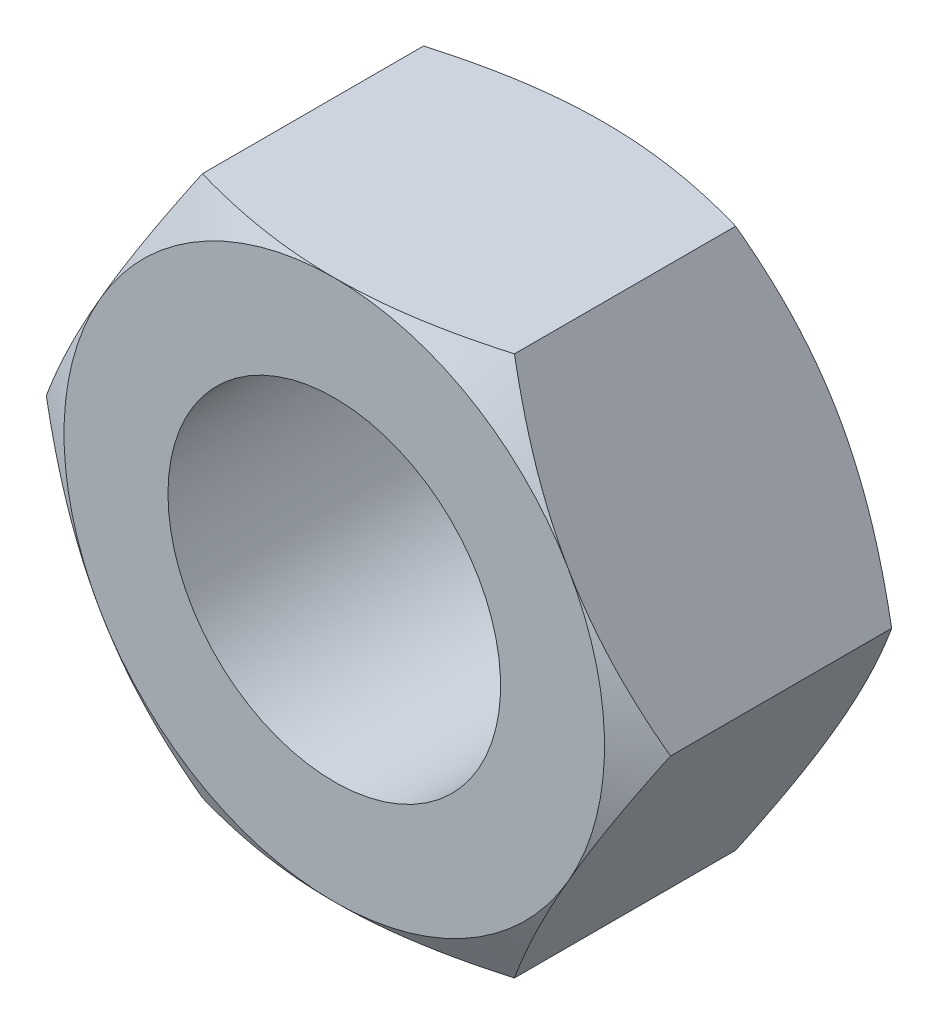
ISO-10303-21;
HEADER;
FILE_DESCRIPTION(('STEP AP214'),'2;1');
FILE_NAME('part.step','',(''),(''),'','','');
FILE_SCHEMA(('AUTOMOTIVE_DESIGN { 1 0 10303 214 1 1 1 1 }'));
ENDSEC;
DATA;
#1=APPLICATION_CONTEXT('core data for automotive mechanical design processes');
#2=APPLICATION_PROTOCOL_DEFINITION('international standard','automotive_design',2000,#1);
#3=PRODUCT_CONTEXT('',#1,'mechanical');
#4=PRODUCT('Part','Part','',(#3));
#5=PRODUCT_RELATED_PRODUCT_CATEGORY('part','',(#4));
#6=PRODUCT_DEFINITION_FORMATION('','',#4);
#7=PRODUCT_DEFINITION_CONTEXT('part definition',#1,'design');
#8=PRODUCT_DEFINITION('design','',#6,#7);
#9=PRODUCT_DEFINITION_SHAPE('','',#8);
#10=(LENGTH_UNIT() NAMED_UNIT(*) SI_UNIT(.MILLI.,.METRE.));
#11=(NAMED_UNIT(*) PLANE_ANGLE_UNIT() SI_UNIT($,.RADIAN.));
#12=(NAMED_UNIT(*) SI_UNIT($,.STERADIAN.) SOLID_ANGLE_UNIT());
#13=UNCERTAINTY_MEASURE_WITH_UNIT(LENGTH_MEASURE(1.E-05),#10,'distance_accuracy_value','');
#14=(GEOMETRIC_REPRESENTATION_CONTEXT(3) GLOBAL_UNCERTAINTY_ASSIGNED_CONTEXT((#13)) GLOBAL_UNIT_ASSIGNED_CONTEXT((#10,
#11,#12)) REPRESENTATION_CONTEXT('',''));
#15=CARTESIAN_POINT('',(0.,0.,0.));
#16=DIRECTION('',(0.,0.,1.));
#17=DIRECTION('',(1.,0.,0.));
#18=AXIS2_PLACEMENT_3D('',#15,#16,#17);
#19=CARTESIAN_POINT('',(-7.50555349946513,0.,6.5));
#20=DIRECTION('',(-0.866025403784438,0.5,0.));
#21=DIRECTION('',(-0.5,-0.866025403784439,0.));
#22=AXIS2_PLACEMENT_3D('',#19,#20,#21);
#23=PLANE('',#22);
#24=DIRECTION('',(0.,0.,-1.));
#25=VECTOR('',#24,1.);
#26=CARTESIAN_POINT('',(-7.50555349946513,0.,6.5));
#27=LINE('',#26,#25);
#28=CARTESIAN_POINT('',(-7.50555349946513,0.,5.91944341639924));
#29=VERTEX_POINT('',#28);
#30=CARTESIAN_POINT('',(-7.50555349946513,0.,0.599587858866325));
#31=VERTEX_POINT('',#30);
#32=EDGE_CURVE('E244',#29,#31,#27,.T.);
#33=ORIENTED_EDGE('',*,*,#32,.F.);
#34=CARTESIAN_POINT('',(-7.50566896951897,-0.00020000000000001,5.91937674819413));
#35=CARTESIAN_POINT('',(-7.4231786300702,0.14267745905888,5.96699557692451));
#36=CARTESIAN_POINT('',(-7.34038072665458,0.286087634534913,6.01245329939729));
#37=CARTESIAN_POINT('',(-7.17411251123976,0.574072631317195,6.09845131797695));
#38=CARTESIAN_POINT('',(-7.09064192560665,0.718647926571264,6.13898949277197));
#39=CARTESIAN_POINT('',(-6.83889369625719,1.15468865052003,6.25242899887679));
#40=CARTESIAN_POINT('',(-6.66962231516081,1.44787528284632,6.31695219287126));
#41=CARTESIAN_POINT('',(-6.41631077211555,1.88662374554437,6.39261341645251));
#42=CARTESIAN_POINT('',(-6.33302748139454,2.03087463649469,6.41416714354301));
#43=CARTESIAN_POINT('',(-6.16608458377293,2.32002821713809,6.45030968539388));
#44=CARTESIAN_POINT('',(-6.08242501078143,2.46493084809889,6.46489911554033));
#45=CARTESIAN_POINT('',(-5.91496056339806,2.75498777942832,6.48674124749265));
#46=CARTESIAN_POINT('',(-5.8311559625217,2.90014160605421,6.49400227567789));
#47=CARTESIAN_POINT('',(-5.66347396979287,3.19057533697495,6.50103969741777));
#48=CARTESIAN_POINT('',(-5.5795965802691,3.33585523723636,6.50081632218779));
#49=CARTESIAN_POINT('',(-5.34979921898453,3.73387594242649,6.48991654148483));
#50=CARTESIAN_POINT('',(-5.20395446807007,3.98648646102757,6.47161818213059));
#51=CARTESIAN_POINT('',(-4.91323365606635,4.49002967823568,6.41359365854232));
#52=CARTESIAN_POINT('',(-4.76835861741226,4.74096060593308,6.37384766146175));
#53=CARTESIAN_POINT('',(-4.47705272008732,5.24551722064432,6.27449409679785));
#54=CARTESIAN_POINT('',(-4.33065861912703,5.49907924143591,6.21446557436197));
#55=CARTESIAN_POINT('',(-4.04005357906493,6.00242193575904,6.07822500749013));
#56=CARTESIAN_POINT('',(-3.89583891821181,6.25220905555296,6.00204496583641));
#57=CARTESIAN_POINT('',(-3.75266127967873,6.5002,5.91937674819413));
#58=B_SPLINE_CURVE_WITH_KNOTS('',3,(#34,#35,#36,#37,#38,#39,#40,#41,#42,#43,#44,#45,#46,#47,#48,
#49,#50,#51,#52,#53,#54,#55,#56,#57),.UNSPECIFIED.,.F.,.F.,(4,2,2,2,2,2,2,2,2,2,2,4),(0.,
0.515105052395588,1.03043143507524,2.06322554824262,2.56697389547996,3.07067772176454,
3.57380860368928,4.0769239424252,4.9527935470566,5.82947446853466,6.72559912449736,
7.61996451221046),.UNSPECIFIED.);
#59=CARTESIAN_POINT('',(-5.62916512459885,3.25,6.5));
#60=VERTEX_POINT('',#59);
#61=EDGE_CURVE('E268',#29,#60,#58,.T.);
#62=ORIENTED_EDGE('',*,*,#61,.T.);
#63=CARTESIAN_POINT('',(-3.75277674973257,6.5,5.91944341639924));
#64=VERTEX_POINT('',#63);
#65=EDGE_CURVE('E109',#60,#64,#58,.T.);
#66=ORIENTED_EDGE('',*,*,#65,.T.);
#67=DIRECTION('',(0.,0.,-1.));
#68=VECTOR('',#67,1.);
#69=CARTESIAN_POINT('',(-3.75277674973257,6.5,6.5));
#70=LINE('',#69,#68);
#71=CARTESIAN_POINT('',(-3.75277674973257,6.5,0.599587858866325));
#72=VERTEX_POINT('',#71);
#73=EDGE_CURVE('E122',#64,#72,#70,.T.);
#74=ORIENTED_EDGE('',*,*,#73,.T.);
#75=CARTESIAN_POINT('',(-3.75266127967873,6.5002,0.599654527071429));
#76=CARTESIAN_POINT('',(-3.8351516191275,6.35732254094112,0.552035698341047));
#77=CARTESIAN_POINT('',(-3.91794952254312,6.21391236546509,0.506577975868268));
#78=CARTESIAN_POINT('',(-4.08421773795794,5.92592736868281,0.420579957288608));
#79=CARTESIAN_POINT('',(-4.16768832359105,5.78135207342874,0.380041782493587));
#80=CARTESIAN_POINT('',(-4.41943655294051,5.34531134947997,0.266602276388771));
#81=CARTESIAN_POINT('',(-4.58870793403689,5.05212471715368,0.202079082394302));
#82=CARTESIAN_POINT('',(-4.84201947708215,4.61337625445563,0.126417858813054));
#83=CARTESIAN_POINT('',(-4.92530276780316,4.46912536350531,0.10486413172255));
#84=CARTESIAN_POINT('',(-5.09224566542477,4.17997178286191,0.0687215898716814));
#85=CARTESIAN_POINT('',(-5.17590523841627,4.03506915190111,0.0541321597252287));
#86=CARTESIAN_POINT('',(-5.34336968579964,3.74501222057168,0.032290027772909));
#87=CARTESIAN_POINT('',(-5.427174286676,3.59985839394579,0.0250289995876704));
#88=CARTESIAN_POINT('',(-5.59485627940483,3.30942466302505,0.017991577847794));
#89=CARTESIAN_POINT('',(-5.6787336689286,3.16414476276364,0.0182149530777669));
#90=CARTESIAN_POINT('',(-5.90853103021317,2.76612405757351,0.0291147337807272));
#91=CARTESIAN_POINT('',(-6.05437578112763,2.51351353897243,0.0474130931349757));
#92=CARTESIAN_POINT('',(-6.34509659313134,2.00997032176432,0.105437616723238));
#93=CARTESIAN_POINT('',(-6.48997163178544,1.75903939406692,0.145183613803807));
#94=CARTESIAN_POINT('',(-6.78127752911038,1.25448277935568,0.244537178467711));
#95=CARTESIAN_POINT('',(-6.92767163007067,1.00092075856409,0.304565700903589));
#96=CARTESIAN_POINT('',(-7.21827667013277,0.497578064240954,0.440806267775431));
#97=CARTESIAN_POINT('',(-7.36249133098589,0.247790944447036,0.516986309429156));
#98=CARTESIAN_POINT('',(-7.50566896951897,-0.000200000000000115,0.59965452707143));
#99=B_SPLINE_CURVE_WITH_KNOTS('',3,(#75,#76,#77,#78,#79,#80,#81,#82,#83,#84,#85,#86,#87,#88,#89,
#90,#91,#92,#93,#94,#95,#96,#97,#98),.UNSPECIFIED.,.F.,.F.,(4,2,2,2,2,2,2,2,2,2,2,4),(0.,
0.515105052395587,1.03043143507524,2.06322554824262,2.56697389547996,3.07067772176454,
3.57380860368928,4.0769239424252,4.9527935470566,5.82947446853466,6.72559912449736,
7.61996451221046),.UNSPECIFIED.);
#100=EDGE_CURVE('E201',#72,#31,#99,.T.);
#101=ORIENTED_EDGE('',*,*,#100,.T.);
#102=EDGE_LOOP('',(#33,#62,#66,#74,#101));
#103=FACE_BOUND('',#102,.T.);
#104=ADVANCED_FACE('F29',(#103),#23,.T.);
#105=CARTESIAN_POINT('',(-3.75277674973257,-6.5,6.5));
#106=DIRECTION('',(-0.866025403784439,-0.5,0.));
#107=DIRECTION('',(0.5,-0.866025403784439,0.));
#108=AXIS2_PLACEMENT_3D('',#105,#106,#107);
#109=PLANE('',#108);
#110=DIRECTION('',(0.,0.,-1.));
#111=VECTOR('',#110,1.);
#112=CARTESIAN_POINT('',(-3.75277674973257,-6.5,6.5));
#113=LINE('',#112,#111);
#114=CARTESIAN_POINT('',(-3.75277674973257,-6.5,5.91944341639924));
#115=VERTEX_POINT('',#114);
#116=CARTESIAN_POINT('',(-3.75277674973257,-6.5,0.599587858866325));
#117=VERTEX_POINT('',#116);
#118=EDGE_CURVE('E242',#115,#117,#113,.T.);
#119=ORIENTED_EDGE('',*,*,#118,.F.);
#120=CARTESIAN_POINT('',(-3.75266127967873,-6.5002,5.91937674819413));
#121=CARTESIAN_POINT('',(-3.8351516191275,-6.35732254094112,5.96699557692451));
#122=CARTESIAN_POINT('',(-3.91794952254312,-6.21391236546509,6.01245329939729));
#123=CARTESIAN_POINT('',(-4.08421773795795,-5.9259273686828,6.09845131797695));
#124=CARTESIAN_POINT('',(-4.16768832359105,-5.78135207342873,6.13898949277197));
#125=CARTESIAN_POINT('',(-4.41943655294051,-5.34531134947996,6.25242899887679));
#126=CARTESIAN_POINT('',(-4.5887079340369,-5.05212471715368,6.31695219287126));
#127=CARTESIAN_POINT('',(-4.84201947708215,-4.61337625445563,6.39261341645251));
#128=CARTESIAN_POINT('',(-4.92530276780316,-4.46912536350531,6.41416714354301));
#129=CARTESIAN_POINT('',(-5.09224566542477,-4.17997178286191,6.45030968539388));
#130=CARTESIAN_POINT('',(-5.17590523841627,-4.03506915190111,6.46489911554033));
#131=CARTESIAN_POINT('',(-5.34336968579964,-3.74501222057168,6.48674124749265));
#132=CARTESIAN_POINT('',(-5.427174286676,-3.59985839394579,6.49400227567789));
#133=CARTESIAN_POINT('',(-5.59485627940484,-3.30942466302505,6.50103969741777));
#134=CARTESIAN_POINT('',(-5.6787336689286,-3.16414476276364,6.50081632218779));
#135=CARTESIAN_POINT('',(-5.90853103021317,-2.7661240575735,6.48991654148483));
#136=CARTESIAN_POINT('',(-6.05437578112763,-2.51351353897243,6.47161818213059));
#137=CARTESIAN_POINT('',(-6.34509659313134,-2.00997032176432,6.41359365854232));
#138=CARTESIAN_POINT('',(-6.48997163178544,-1.75903939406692,6.37384766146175));
#139=CARTESIAN_POINT('',(-6.78127752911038,-1.25448277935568,6.27449409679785));
#140=CARTESIAN_POINT('',(-6.92767163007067,-1.00092075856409,6.21446557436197));
#141=CARTESIAN_POINT('',(-7.21827667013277,-0.497578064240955,6.07822500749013));
#142=CARTESIAN_POINT('',(-7.36249133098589,-0.247790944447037,6.00204496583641));
#143=CARTESIAN_POINT('',(-7.50566896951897,0.000199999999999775,5.91937674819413));
#144=B_SPLINE_CURVE_WITH_KNOTS('',3,(#120,#121,#122,#123,#124,#125,#126,#127,#128,#129,#130,
#131,#132,#133,#134,#135,#136,#137,#138,#139,#140,#141,#142,#143),.UNSPECIFIED.,.F.,.F.,(4,2,2,
2,2,2,2,2,2,2,2,4),(0.,0.515105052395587,1.03043143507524,2.06322554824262,2.56697389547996,
3.07067772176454,3.57380860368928,4.0769239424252,4.9527935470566,5.82947446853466,
6.72559912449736,7.61996451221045),.UNSPECIFIED.);
#145=CARTESIAN_POINT('',(-5.62916512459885,-3.25,6.5));
#146=VERTEX_POINT('',#145);
#147=EDGE_CURVE('E165',#115,#146,#144,.T.);
#148=ORIENTED_EDGE('',*,*,#147,.T.);
#149=EDGE_CURVE('E160',#146,#29,#144,.T.);
#150=ORIENTED_EDGE('',*,*,#149,.T.);
#151=ORIENTED_EDGE('',*,*,#32,.T.);
#152=CARTESIAN_POINT('',(-7.50566896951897,0.000200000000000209,0.59965452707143));
#153=CARTESIAN_POINT('',(-7.4231786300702,-0.14267745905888,0.552035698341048));
#154=CARTESIAN_POINT('',(-7.34038072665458,-0.286087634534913,0.506577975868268));
#155=CARTESIAN_POINT('',(-7.17411251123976,-0.574072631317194,0.420579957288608));
#156=CARTESIAN_POINT('',(-7.09064192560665,-0.718647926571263,0.380041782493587));
#157=CARTESIAN_POINT('',(-6.83889369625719,-1.15468865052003,0.26660227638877));
#158=CARTESIAN_POINT('',(-6.66962231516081,-1.44787528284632,0.202079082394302));
#159=CARTESIAN_POINT('',(-6.41631077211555,-1.88662374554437,0.126417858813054));
#160=CARTESIAN_POINT('',(-6.33302748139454,-2.03087463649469,0.10486413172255));
#161=CARTESIAN_POINT('',(-6.16608458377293,-2.32002821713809,0.0687215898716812));
#162=CARTESIAN_POINT('',(-6.08242501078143,-2.46493084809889,0.0541321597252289));
#163=CARTESIAN_POINT('',(-5.91496056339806,-2.75498777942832,0.0322900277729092));
#164=CARTESIAN_POINT('',(-5.8311559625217,-2.90014160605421,0.0250289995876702));
#165=CARTESIAN_POINT('',(-5.66347396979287,-3.19057533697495,0.0179915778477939));
#166=CARTESIAN_POINT('',(-5.5795965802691,-3.33585523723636,0.0182149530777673));
#167=CARTESIAN_POINT('',(-5.34979921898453,-3.73387594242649,0.0291147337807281));
#168=CARTESIAN_POINT('',(-5.20395446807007,-3.98648646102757,0.0474130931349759));
#169=CARTESIAN_POINT('',(-4.91323365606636,-4.49002967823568,0.105437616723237));
#170=CARTESIAN_POINT('',(-4.76835861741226,-4.74096060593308,0.145183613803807));
#171=CARTESIAN_POINT('',(-4.47705272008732,-5.24551722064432,0.244537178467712));
#172=CARTESIAN_POINT('',(-4.33065861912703,-5.49907924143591,0.304565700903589));
#173=CARTESIAN_POINT('',(-4.04005357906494,-6.00242193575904,0.440806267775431));
#174=CARTESIAN_POINT('',(-3.89583891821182,-6.25220905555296,0.516986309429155));
#175=CARTESIAN_POINT('',(-3.75266127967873,-6.5002,0.599654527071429));
#176=B_SPLINE_CURVE_WITH_KNOTS('',3,(#152,#153,#154,#155,#156,#157,#158,#159,#160,#161,#162,
#163,#164,#165,#166,#167,#168,#169,#170,#171,#172,#173,#174,#175),.UNSPECIFIED.,.F.,.F.,(4,2,2,
2,2,2,2,2,2,2,2,4),(0.,0.515105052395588,1.03043143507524,2.06322554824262,2.56697389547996,
3.07067772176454,3.57380860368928,4.0769239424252,4.9527935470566,5.82947446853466,
6.72559912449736,7.61996451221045),.UNSPECIFIED.);
#177=EDGE_CURVE('E191',#31,#117,#176,.T.);
#178=ORIENTED_EDGE('',*,*,#177,.T.);
#179=EDGE_LOOP('',(#119,#148,#150,#151,#178));
#180=FACE_BOUND('',#179,.T.);
#181=ADVANCED_FACE('F31',(#180),#109,.T.);
#182=CARTESIAN_POINT('',(3.75277674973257,-6.5,6.5));
#183=DIRECTION('',(0.,-1.,0.));
#184=DIRECTION('',(1.,0.,0.));
#185=AXIS2_PLACEMENT_3D('',#182,#183,#184);
#186=PLANE('',#185);
#187=DIRECTION('',(0.,0.,-1.));
#188=VECTOR('',#187,1.);
#189=CARTESIAN_POINT('',(3.75277674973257,-6.5,6.5));
#190=LINE('',#189,#188);
#191=CARTESIAN_POINT('',(3.75277674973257,-6.5,5.91944341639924));
#192=VERTEX_POINT('',#191);
#193=CARTESIAN_POINT('',(3.75277674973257,-6.5,0.599587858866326));
#194=VERTEX_POINT('',#193);
#195=EDGE_CURVE('E240',#192,#194,#190,.T.);
#196=ORIENTED_EDGE('',*,*,#195,.F.);
#197=CARTESIAN_POINT('',(-9.97729078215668,-6.5,3.37778992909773));
#198=CARTESIAN_POINT('',(-9.69171336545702,-6.5,3.51589773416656));
#199=CARTESIAN_POINT('',(-9.40546350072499,-6.5,3.65264008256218));
#200=CARTESIAN_POINT('',(-8.83125541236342,-6.5,3.92261416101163));
#201=CARTESIAN_POINT('',(-8.54329690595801,-6.5,4.05584528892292));
#202=CARTESIAN_POINT('',(-7.96376453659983,-6.5,4.31871378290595));
#203=CARTESIAN_POINT('',(-7.67217942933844,-6.5,4.44832644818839));
#204=CARTESIAN_POINT('',(-7.08662161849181,-6.5,4.70201960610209));
#205=CARTESIAN_POINT('',(-6.79264903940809,-6.5,4.82610038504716));
#206=CARTESIAN_POINT('',(-6.19808627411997,-6.5,5.06877929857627));
#207=CARTESIAN_POINT('',(-5.89745942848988,-6.5,5.18728810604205));
#208=CARTESIAN_POINT('',(-5.2926682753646,-6.5,5.4150847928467));
#209=CARTESIAN_POINT('',(-4.98850357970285,-6.5,5.52437164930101));
#210=CARTESIAN_POINT('',(-4.37677053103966,-6.5,5.73080602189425));
#211=CARTESIAN_POINT('',(-4.06921090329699,-6.5,5.82797913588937));
#212=CARTESIAN_POINT('',(-3.44971499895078,-6.5,6.00704483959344));
#213=CARTESIAN_POINT('',(-3.13778013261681,-6.5,6.08894223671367));
#214=CARTESIAN_POINT('',(-2.50934586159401,-6.5,6.23349791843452));
#215=CARTESIAN_POINT('',(-2.19284556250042,-6.5,6.29615237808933));
#216=CARTESIAN_POINT('',(-1.55595746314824,-6.5,6.39800935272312));
#217=CARTESIAN_POINT('',(-1.23556966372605,-6.5,6.43721187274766));
#218=CARTESIAN_POINT('',(-0.754463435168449,-6.5,6.47591420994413));
#219=CARTESIAN_POINT('',(-0.594513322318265,-6.5,6.48546592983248));
#220=CARTESIAN_POINT('',(-0.274344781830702,-6.5,6.49778928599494));
#221=CARTESIAN_POINT('',(-0.114126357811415,-6.5,6.50056101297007));
#222=CARTESIAN_POINT('',(0.206235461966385,-6.5,6.49925059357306));
#223=CARTESIAN_POINT('',(0.366378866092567,-6.5,6.49517040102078));
#224=CARTESIAN_POINT('',(0.686354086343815,-6.5,6.48026033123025));
#225=CARTESIAN_POINT('',(0.846185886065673,-6.5,6.46943010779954));
#226=CARTESIAN_POINT('',(1.2327891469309,-6.5,6.43529633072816));
#227=CARTESIAN_POINT('',(1.45927065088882,-6.5,6.40865406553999));
#228=CARTESIAN_POINT('',(1.91051467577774,-6.5,6.34328838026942));
#229=CARTESIAN_POINT('',(2.13527671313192,-6.5,6.30456168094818));
#230=CARTESIAN_POINT('',(2.58289078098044,-6.5,6.21640031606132));
#231=CARTESIAN_POINT('',(2.80574081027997,-6.5,6.16695558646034));
#232=CARTESIAN_POINT('',(3.24915578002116,-6.5,6.05886819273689));
#233=CARTESIAN_POINT('',(3.46972093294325,-6.5,6.00022639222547));
#234=CARTESIAN_POINT('',(3.9140319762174,-6.5,5.87360684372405));
#235=CARTESIAN_POINT('',(4.13772199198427,-6.5,5.80543437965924));
#236=CARTESIAN_POINT('',(4.58273815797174,-6.5,5.66230180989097));
#237=CARTESIAN_POINT('',(4.80406581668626,-6.5,5.58734636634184));
#238=CARTESIAN_POINT('',(5.24346964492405,-6.5,5.4322004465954));
#239=CARTESIAN_POINT('',(5.46155709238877,-6.5,5.35204171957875));
#240=CARTESIAN_POINT('',(5.89603554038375,-6.5,5.18698596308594));
#241=CARTESIAN_POINT('',(6.11242582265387,-6.5,5.10208703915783));
#242=CARTESIAN_POINT('',(6.32802770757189,-6.5,5.01528578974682));
#243=B_SPLINE_CURVE_WITH_KNOTS('',3,(#197,#198,#199,#200,#201,#202,#203,#204,#205,#206,#207,
#208,#209,#210,#211,#212,#213,#214,#215,#216,#217,#218,#219,#220,#221,#222,#223,#224,#225,#226,
#227,#228,#229,#230,#231,#232,#233,#234,#235,#236,#237,#238,#239,#240,#241,#242),.UNSPECIFIED.,
.F.,.F.,(4,2,2,2,2,2,2,2,2,2,2,2,2,2,2,2,2,2,2,2,2,2,4),(0.,0.951671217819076,1.90350459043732,
2.86074248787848,3.81793078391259,4.7872403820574,5.75665735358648,6.72398979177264,
7.69101728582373,8.65823687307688,9.62545625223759,10.1060393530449,10.5866160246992,
11.0670556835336,11.5475199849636,12.231269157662,12.9152040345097,13.5997839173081,
14.2842995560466,14.9857115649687,15.6866450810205,16.3836438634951,17.0809232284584),.UNSPECIFIED.);
#244=CARTESIAN_POINT('',(0.,-6.5,6.5));
#245=VERTEX_POINT('',#244);
#246=EDGE_CURVE('E172',#192,#245,#243,.F.);
#247=ORIENTED_EDGE('',*,*,#246,.T.);
#248=EDGE_CURVE('E166',#245,#115,#243,.F.);
#249=ORIENTED_EDGE('',*,*,#248,.T.);
#250=ORIENTED_EDGE('',*,*,#118,.T.);
#251=CARTESIAN_POINT('',(-9.96661758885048,-6.5,3.13607902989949));
#252=CARTESIAN_POINT('',(-9.68112387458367,-6.5,2.99805586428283));
#253=CARTESIAN_POINT('',(-9.39495670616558,-6.5,2.86140057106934));
#254=CARTESIAN_POINT('',(-8.82091139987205,-6.5,2.59160706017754));
#255=CARTESIAN_POINT('',(-8.53303297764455,-6.5,2.45846944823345));
#256=CARTESIAN_POINT('',(-7.95365275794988,-6.5,2.1957942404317));
#257=CARTESIAN_POINT('',(-7.66213966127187,-6.5,2.06628147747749));
#258=CARTESIAN_POINT('',(-7.07672252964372,-6.5,1.81279913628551));
#259=CARTESIAN_POINT('',(-6.78281861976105,-6.5,1.68882927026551));
#260=CARTESIAN_POINT('',(-6.18844025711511,-6.5,1.44640819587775));
#261=CARTESIAN_POINT('',(-5.88792959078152,-6.5,1.32804529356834));
#262=CARTESIAN_POINT('',(-5.28336835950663,-6.5,1.10055554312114));
#263=CARTESIAN_POINT('',(-4.9793174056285,-6.5,0.991429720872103));
#264=CARTESIAN_POINT('',(-4.36781288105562,-6.5,0.785336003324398));
#265=CARTESIAN_POINT('',(-4.06036806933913,-6.5,0.688342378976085));
#266=CARTESIAN_POINT('',(-3.44110389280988,-6.5,0.509655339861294));
#267=CARTESIAN_POINT('',(-3.12928594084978,-6.5,0.427957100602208));
#268=CARTESIAN_POINT('',(-2.50108319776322,-6.5,0.283815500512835));
#269=CARTESIAN_POINT('',(-2.18469738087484,-6.5,0.221376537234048));
#270=CARTESIAN_POINT('',(-1.54805154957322,-6.5,0.119961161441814));
#271=CARTESIAN_POINT('',(-1.2277915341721,-6.5,0.0809847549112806));
#272=CARTESIAN_POINT('',(-0.746883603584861,-6.5,0.0426153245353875));
#273=CARTESIAN_POINT('',(-0.586997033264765,-6.5,0.0331732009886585));
#274=CARTESIAN_POINT('',(-0.266960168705,-6.5,0.0210653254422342));
#275=CARTESIAN_POINT('',(-0.106809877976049,-6.5,0.0183994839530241));
#276=CARTESIAN_POINT('',(0.213411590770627,-6.5,0.0199154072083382));
#277=CARTESIAN_POINT('',(0.373482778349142,-6.5,0.0240952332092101));
#278=CARTESIAN_POINT('',(0.693309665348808,-6.5,0.039196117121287));
#279=CARTESIAN_POINT('',(0.853065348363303,-6.5,0.0501175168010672));
#280=CARTESIAN_POINT('',(1.23982473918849,-6.5,0.0844905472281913));
#281=CARTESIAN_POINT('',(1.46653525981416,-6.5,0.111295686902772));
#282=CARTESIAN_POINT('',(1.91822836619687,-6.5,0.176998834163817));
#283=CARTESIAN_POINT('',(2.14321046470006,-6.5,0.215900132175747));
#284=CARTESIAN_POINT('',(2.59125792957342,-6.5,0.304416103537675));
#285=CARTESIAN_POINT('',(2.81432128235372,-6.5,0.35404087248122));
#286=CARTESIAN_POINT('',(3.25815732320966,-6.5,0.46248886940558));
#287=CARTESIAN_POINT('',(3.47893022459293,-6.5,0.521311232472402));
#288=CARTESIAN_POINT('',(3.92364177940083,-6.5,0.648289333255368));
#289=CARTESIAN_POINT('',(4.14752463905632,-6.5,0.716639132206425));
#290=CARTESIAN_POINT('',(4.59292420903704,-6.5,0.860121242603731));
#291=CARTESIAN_POINT('',(4.81444243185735,-6.5,0.935248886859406));
#292=CARTESIAN_POINT('',(5.25422412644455,-6.5,1.09073241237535));
#293=CARTESIAN_POINT('',(5.47249889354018,-6.5,1.17105653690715));
#294=CARTESIAN_POINT('',(5.90735244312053,-6.5,1.33643817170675));
#295=CARTESIAN_POINT('',(6.12393050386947,-6.5,1.42149758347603));
#296=CARTESIAN_POINT('',(6.33972047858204,-6.5,1.50845685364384));
#297=B_SPLINE_CURVE_WITH_KNOTS('',3,(#251,#252,#253,#254,#255,#256,#257,#258,#259,#260,#261,
#262,#263,#264,#265,#266,#267,#268,#269,#270,#271,#272,#273,#274,#275,#276,#277,#278,#279,#280,
#281,#282,#283,#284,#285,#286,#287,#288,#289,#290,#291,#292,#293,#294,#295,#296),.UNSPECIFIED.,
.F.,.F.,(4,2,2,2,2,2,2,2,2,2,2,2,2,2,2,2,2,2,2,2,2,2,4),(0.,0.951334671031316,1.9028321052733,
2.85975068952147,3.81661953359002,4.7854439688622,5.75437586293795,6.72121676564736,
7.68775219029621,8.65450814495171,9.62126434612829,10.1016377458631,10.5820048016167,
11.0622358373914,11.5424912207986,12.2269792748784,12.9116536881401,13.5969755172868,
14.2822329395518,14.9843537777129,15.6859947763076,16.3836924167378,17.081672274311),.UNSPECIFIED.);
#298=EDGE_CURVE('E184',#117,#194,#297,.T.);
#299=ORIENTED_EDGE('',*,*,#298,.T.);
#300=EDGE_LOOP('',(#196,#247,#249,#250,#299));
#301=FACE_BOUND('',#300,.T.);
#302=ADVANCED_FACE('F176',(#301),#186,.T.);
#303=CARTESIAN_POINT('',(7.50555349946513,0.,6.5));
#304=DIRECTION('',(0.866025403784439,-0.5,0.));
#305=DIRECTION('',(0.5,0.866025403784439,0.));
#306=AXIS2_PLACEMENT_3D('',#303,#304,#305);
#307=PLANE('',#306);
#308=DIRECTION('',(0.,0.,-1.));
#309=VECTOR('',#308,1.);
#310=CARTESIAN_POINT('',(7.50555349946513,0.,6.5));
#311=LINE('',#310,#309);
#312=CARTESIAN_POINT('',(7.50555349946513,0.,5.91944341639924));
#313=VERTEX_POINT('',#312);
#314=CARTESIAN_POINT('',(7.50555349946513,0.,0.599587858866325));
#315=VERTEX_POINT('',#314);
#316=EDGE_CURVE('E238',#313,#315,#311,.T.);
#317=ORIENTED_EDGE('',*,*,#316,.F.);
#318=CARTESIAN_POINT('',(7.50566896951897,0.000199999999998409,5.91937674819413));
#319=CARTESIAN_POINT('',(7.4231786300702,-0.142677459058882,5.96699557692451));
#320=CARTESIAN_POINT('',(7.34038072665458,-0.286087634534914,6.01245329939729));
#321=CARTESIAN_POINT('',(7.17411251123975,-0.574072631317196,6.09845131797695));
#322=CARTESIAN_POINT('',(7.09064192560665,-0.718647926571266,6.13898949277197));
#323=CARTESIAN_POINT('',(6.83889369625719,-1.15468865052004,6.25242899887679));
#324=CARTESIAN_POINT('',(6.66962231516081,-1.44787528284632,6.31695219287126));
#325=CARTESIAN_POINT('',(6.41631077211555,-1.88662374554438,6.39261341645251));
#326=CARTESIAN_POINT('',(6.33302748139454,-2.03087463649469,6.41416714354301));
#327=CARTESIAN_POINT('',(6.16608458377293,-2.32002821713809,6.45030968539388));
#328=CARTESIAN_POINT('',(6.08242501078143,-2.46493084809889,6.46489911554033));
#329=CARTESIAN_POINT('',(5.91496056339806,-2.75498777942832,6.48674124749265));
#330=CARTESIAN_POINT('',(5.8311559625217,-2.90014160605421,6.49400227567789));
#331=CARTESIAN_POINT('',(5.66347396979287,-3.19057533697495,6.50103969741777));
#332=CARTESIAN_POINT('',(5.5795965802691,-3.33585523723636,6.50081632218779));
#333=CARTESIAN_POINT('',(5.34979921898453,-3.7338759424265,6.48991654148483));
#334=CARTESIAN_POINT('',(5.20395446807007,-3.98648646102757,6.47161818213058));
#335=CARTESIAN_POINT('',(4.91323365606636,-4.49002967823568,6.41359365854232));
#336=CARTESIAN_POINT('',(4.76835861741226,-4.74096060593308,6.37384766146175));
#337=CARTESIAN_POINT('',(4.47705272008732,-5.24551722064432,6.27449409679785));
#338=CARTESIAN_POINT('',(4.33065861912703,-5.49907924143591,6.21446557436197));
#339=CARTESIAN_POINT('',(4.04005357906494,-6.00242193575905,6.07822500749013));
#340=CARTESIAN_POINT('',(3.89583891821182,-6.25220905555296,6.00204496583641));
#341=CARTESIAN_POINT('',(3.75266127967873,-6.5002,5.91937674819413));
#342=B_SPLINE_CURVE_WITH_KNOTS('',3,(#318,#319,#320,#321,#322,#323,#324,#325,#326,#327,#328,
#329,#330,#331,#332,#333,#334,#335,#336,#337,#338,#339,#340,#341),.UNSPECIFIED.,.F.,.F.,(4,2,2,
2,2,2,2,2,2,2,2,4),(0.,0.515105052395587,1.03043143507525,2.06322554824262,2.56697389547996,
3.07067772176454,3.57380860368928,4.0769239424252,4.9527935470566,5.82947446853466,
6.72559912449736,7.61996451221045),.UNSPECIFIED.);
#343=CARTESIAN_POINT('',(5.62916512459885,-3.25,6.5));
#344=VERTEX_POINT('',#343);
#345=EDGE_CURVE('E154',#313,#344,#342,.T.);
#346=ORIENTED_EDGE('',*,*,#345,.T.);
#347=EDGE_CURVE('E173',#344,#192,#342,.T.);
#348=ORIENTED_EDGE('',*,*,#347,.T.);
#349=ORIENTED_EDGE('',*,*,#195,.T.);
#350=CARTESIAN_POINT('',(3.75266127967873,-6.5002,0.59965452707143));
#351=CARTESIAN_POINT('',(3.8351516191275,-6.35732254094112,0.552035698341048));
#352=CARTESIAN_POINT('',(3.91794952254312,-6.21391236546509,0.506577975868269));
#353=CARTESIAN_POINT('',(4.08421773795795,-5.92592736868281,0.420579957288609));
#354=CARTESIAN_POINT('',(4.16768832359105,-5.78135207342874,0.380041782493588));
#355=CARTESIAN_POINT('',(4.41943655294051,-5.34531134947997,0.266602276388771));
#356=CARTESIAN_POINT('',(4.58870793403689,-5.05212471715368,0.202079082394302));
#357=CARTESIAN_POINT('',(4.84201947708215,-4.61337625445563,0.126417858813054));
#358=CARTESIAN_POINT('',(4.92530276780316,-4.46912536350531,0.104864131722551));
#359=CARTESIAN_POINT('',(5.09224566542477,-4.17997178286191,0.068721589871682));
#360=CARTESIAN_POINT('',(5.17590523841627,-4.03506915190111,0.0541321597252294));
#361=CARTESIAN_POINT('',(5.34336968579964,-3.74501222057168,0.0322900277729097));
#362=CARTESIAN_POINT('',(5.427174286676,-3.59985839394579,0.0250289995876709));
#363=CARTESIAN_POINT('',(5.59485627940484,-3.30942466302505,0.0179915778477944));
#364=CARTESIAN_POINT('',(5.6787336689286,-3.16414476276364,0.0182149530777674));
#365=CARTESIAN_POINT('',(5.90853103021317,-2.76612405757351,0.0291147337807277));
#366=CARTESIAN_POINT('',(6.05437578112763,-2.51351353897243,0.0474130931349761));
#367=CARTESIAN_POINT('',(6.34509659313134,-2.00997032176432,0.105437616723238));
#368=CARTESIAN_POINT('',(6.48997163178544,-1.75903939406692,0.145183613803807));
#369=CARTESIAN_POINT('',(6.78127752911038,-1.25448277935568,0.244537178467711));
#370=CARTESIAN_POINT('',(6.92767163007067,-1.00092075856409,0.304565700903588));
#371=CARTESIAN_POINT('',(7.21827667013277,-0.497578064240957,0.44080626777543));
#372=CARTESIAN_POINT('',(7.36249133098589,-0.247790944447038,0.516986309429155));
#373=CARTESIAN_POINT('',(7.50566896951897,0.00019999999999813,0.599654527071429));
#374=B_SPLINE_CURVE_WITH_KNOTS('',3,(#350,#351,#352,#353,#354,#355,#356,#357,#358,#359,#360,
#361,#362,#363,#364,#365,#366,#367,#368,#369,#370,#371,#372,#373),.UNSPECIFIED.,.F.,.F.,(4,2,2,
2,2,2,2,2,2,2,2,4),(0.,0.515105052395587,1.03043143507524,2.06322554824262,2.56697389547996,
3.07067772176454,3.57380860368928,4.0769239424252,4.9527935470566,5.82947446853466,
6.72559912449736,7.61996451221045),.UNSPECIFIED.);
#375=EDGE_CURVE('E192',#194,#315,#374,.T.);
#376=ORIENTED_EDGE('',*,*,#375,.T.);
#377=EDGE_LOOP('',(#317,#346,#348,#349,#376));
#378=FACE_BOUND('',#377,.T.);
#379=ADVANCED_FACE('F179',(#378),#307,.T.);
#380=CARTESIAN_POINT('',(3.75277674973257,6.5,6.5));
#381=DIRECTION('',(0.866025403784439,0.5,0.));
#382=DIRECTION('',(-0.5,0.866025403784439,0.));
#383=AXIS2_PLACEMENT_3D('',#380,#381,#382);
#384=PLANE('',#383);
#385=DIRECTION('',(0.,0.,-1.));
#386=VECTOR('',#385,1.);
#387=CARTESIAN_POINT('',(3.75277674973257,6.5,6.5));
#388=LINE('',#387,#386);
#389=CARTESIAN_POINT('',(3.75277674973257,6.5,5.91944341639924));
#390=VERTEX_POINT('',#389);
#391=CARTESIAN_POINT('',(3.75277674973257,6.5,0.599587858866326));
#392=VERTEX_POINT('',#391);
#393=EDGE_CURVE('E234',#390,#392,#388,.T.);
#394=ORIENTED_EDGE('',*,*,#393,.F.);
#395=CARTESIAN_POINT('',(3.75266127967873,6.5002,5.91937674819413));
#396=CARTESIAN_POINT('',(3.8351516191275,6.35732254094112,5.96699557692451));
#397=CARTESIAN_POINT('',(3.91794952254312,6.21391236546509,6.01245329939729));
#398=CARTESIAN_POINT('',(4.08421773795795,5.9259273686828,6.09845131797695));
#399=CARTESIAN_POINT('',(4.16768832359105,5.78135207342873,6.13898949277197));
#400=CARTESIAN_POINT('',(4.41943655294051,5.34531134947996,6.25242899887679));
#401=CARTESIAN_POINT('',(4.5887079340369,5.05212471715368,6.31695219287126));
#402=CARTESIAN_POINT('',(4.84201947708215,4.61337625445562,6.39261341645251));
#403=CARTESIAN_POINT('',(4.92530276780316,4.46912536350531,6.41416714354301));
#404=CARTESIAN_POINT('',(5.09224566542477,4.17997178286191,6.45030968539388));
#405=CARTESIAN_POINT('',(5.17590523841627,4.03506915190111,6.46489911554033));
#406=CARTESIAN_POINT('',(5.34336968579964,3.74501222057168,6.48674124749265));
#407=CARTESIAN_POINT('',(5.427174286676,3.59985839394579,6.49400227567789));
#408=CARTESIAN_POINT('',(5.59485627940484,3.30942466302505,6.50103969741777));
#409=CARTESIAN_POINT('',(5.6787336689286,3.16414476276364,6.50081632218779));
#410=CARTESIAN_POINT('',(5.90853103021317,2.7661240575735,6.48991654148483));
#411=CARTESIAN_POINT('',(6.05437578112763,2.51351353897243,6.47161818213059));
#412=CARTESIAN_POINT('',(6.34509659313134,2.00997032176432,6.41359365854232));
#413=CARTESIAN_POINT('',(6.48997163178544,1.75903939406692,6.37384766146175));
#414=CARTESIAN_POINT('',(6.78127752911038,1.25448277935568,6.27449409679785));
#415=CARTESIAN_POINT('',(6.92767163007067,1.00092075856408,6.21446557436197));
#416=CARTESIAN_POINT('',(7.21827667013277,0.497578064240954,6.07822500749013));
#417=CARTESIAN_POINT('',(7.36249133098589,0.247790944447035,6.00204496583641));
#418=CARTESIAN_POINT('',(7.50566896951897,-0.000200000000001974,5.91937674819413));
#419=B_SPLINE_CURVE_WITH_KNOTS('',3,(#395,#396,#397,#398,#399,#400,#401,#402,#403,#404,#405,
#406,#407,#408,#409,#410,#411,#412,#413,#414,#415,#416,#417,#418),.UNSPECIFIED.,.F.,.F.,(4,2,2,
2,2,2,2,2,2,2,2,4),(0.,0.515105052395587,1.03043143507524,2.06322554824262,2.56697389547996,
3.07067772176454,3.57380860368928,4.0769239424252,4.9527935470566,5.82947446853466,
6.72559912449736,7.61996451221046),.UNSPECIFIED.);
#420=CARTESIAN_POINT('',(5.62916512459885,3.25,6.5));
#421=VERTEX_POINT('',#420);
#422=EDGE_CURVE('E50',#390,#421,#419,.T.);
#423=ORIENTED_EDGE('',*,*,#422,.T.);
#424=EDGE_CURVE('E124',#421,#313,#419,.T.);
#425=ORIENTED_EDGE('',*,*,#424,.T.);
#426=ORIENTED_EDGE('',*,*,#316,.T.);
#427=CARTESIAN_POINT('',(7.50566896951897,-0.000200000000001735,0.599654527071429));
#428=CARTESIAN_POINT('',(7.4231786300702,0.142677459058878,0.552035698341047));
#429=CARTESIAN_POINT('',(7.34038072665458,0.286087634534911,0.506577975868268));
#430=CARTESIAN_POINT('',(7.17411251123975,0.574072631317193,0.420579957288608));
#431=CARTESIAN_POINT('',(7.09064192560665,0.718647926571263,0.380041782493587));
#432=CARTESIAN_POINT('',(6.83889369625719,1.15468865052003,0.266602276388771));
#433=CARTESIAN_POINT('',(6.66962231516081,1.44787528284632,0.202079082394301));
#434=CARTESIAN_POINT('',(6.41631077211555,1.88662374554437,0.126417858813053));
#435=CARTESIAN_POINT('',(6.33302748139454,2.03087463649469,0.10486413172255));
#436=CARTESIAN_POINT('',(6.16608458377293,2.32002821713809,0.0687215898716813));
#437=CARTESIAN_POINT('',(6.08242501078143,2.46493084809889,0.0541321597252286));
#438=CARTESIAN_POINT('',(5.91496056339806,2.75498777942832,0.0322900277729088));
#439=CARTESIAN_POINT('',(5.8311559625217,2.90014160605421,0.0250289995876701));
#440=CARTESIAN_POINT('',(5.66347396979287,3.19057533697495,0.017991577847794));
#441=CARTESIAN_POINT('',(5.5795965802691,3.33585523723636,0.0182149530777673));
#442=CARTESIAN_POINT('',(5.34979921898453,3.73387594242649,0.0291147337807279));
#443=CARTESIAN_POINT('',(5.20395446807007,3.98648646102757,0.047413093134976));
#444=CARTESIAN_POINT('',(4.91323365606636,4.49002967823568,0.105437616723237));
#445=CARTESIAN_POINT('',(4.76835861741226,4.74096060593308,0.145183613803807));
#446=CARTESIAN_POINT('',(4.47705272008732,5.24551722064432,0.244537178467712));
#447=CARTESIAN_POINT('',(4.33065861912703,5.49907924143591,0.304565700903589));
#448=CARTESIAN_POINT('',(4.04005357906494,6.00242193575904,0.440806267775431));
#449=CARTESIAN_POINT('',(3.89583891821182,6.25220905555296,0.516986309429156));
#450=CARTESIAN_POINT('',(3.75266127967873,6.5002,0.59965452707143));
#451=B_SPLINE_CURVE_WITH_KNOTS('',3,(#427,#428,#429,#430,#431,#432,#433,#434,#435,#436,#437,
#438,#439,#440,#441,#442,#443,#444,#445,#446,#447,#448,#449,#450),.UNSPECIFIED.,.F.,.F.,(4,2,2,
2,2,2,2,2,2,2,2,4),(0.,0.515105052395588,1.03043143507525,2.06322554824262,2.56697389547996,
3.07067772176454,3.57380860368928,4.0769239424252,4.9527935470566,5.82947446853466,
6.72559912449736,7.61996451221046),.UNSPECIFIED.);
#452=EDGE_CURVE('E368',#315,#392,#451,.T.);
#453=ORIENTED_EDGE('',*,*,#452,.T.);
#454=EDGE_LOOP('',(#394,#423,#425,#426,#453));
#455=FACE_BOUND('',#454,.T.);
#456=ADVANCED_FACE('F333',(#455),#384,.T.);
#457=CARTESIAN_POINT('',(-3.75277674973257,6.5,6.5));
#458=DIRECTION('',(0.,1.,0.));
#459=DIRECTION('',(-1.,0.,0.));
#460=AXIS2_PLACEMENT_3D('',#457,#458,#459);
#461=PLANE('',#460);
#462=ORIENTED_EDGE('',*,*,#73,.F.);
#463=CARTESIAN_POINT('',(-9.97729262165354,6.5,3.37778903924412));
#464=CARTESIAN_POINT('',(-9.69171514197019,6.5,3.51589688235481));
#465=CARTESIAN_POINT('',(-9.40546521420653,6.5,3.65263926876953));
#466=CARTESIAN_POINT('',(-8.83125699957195,6.5,3.92261342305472));
#467=CARTESIAN_POINT('',(-8.54329842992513,6.5,4.05584458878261));
#468=CARTESIAN_POINT('',(-7.96376593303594,6.5,4.31871315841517));
#469=CARTESIAN_POINT('',(-7.67218076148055,6.5,4.44832586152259));
#470=CARTESIAN_POINT('',(-7.08662282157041,6.5,4.70201909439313));
#471=CARTESIAN_POINT('',(-6.79265017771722,6.5,4.8260999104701));
#472=CARTESIAN_POINT('',(-6.19808728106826,6.5,5.0687788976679));
#473=CARTESIAN_POINT('',(-5.8974603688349,6.5,5.18728774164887));
#474=CARTESIAN_POINT('',(-5.29266908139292,6.5,5.41508449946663));
#475=CARTESIAN_POINT('',(-4.98850431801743,6.5,5.52437139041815));
#476=CARTESIAN_POINT('',(-4.37677113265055,6.5,5.73080582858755));
#477=CARTESIAN_POINT('',(-4.06921143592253,6.5,5.82797897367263));
#478=CARTESIAN_POINT('',(-3.44971539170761,6.5,6.00704473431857));
#479=CARTESIAN_POINT('',(-3.1377804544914,6.5,6.08894215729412));
#480=CARTESIAN_POINT('',(-2.50934600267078,6.5,6.23349789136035));
#481=CARTESIAN_POINT('',(-2.19284559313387,6.5,6.29615237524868));
#482=CARTESIAN_POINT('',(-1.55595727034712,6.5,6.39800938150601));
#483=CARTESIAN_POINT('',(-1.23556935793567,6.5,6.43721190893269));
#484=CARTESIAN_POINT('',(-0.75446296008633,6.5,6.47591424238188));
#485=CARTESIAN_POINT('',(-0.594512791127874,6.5,6.48546595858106));
#486=CARTESIAN_POINT('',(-0.274344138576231,6.5,6.49778930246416));
#487=CARTESIAN_POINT('',(-0.11412565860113,6.5,6.50056102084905));
#488=CARTESIAN_POINT('',(0.206236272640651,6.5,6.49925057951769));
#489=CARTESIAN_POINT('',(0.366379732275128,6.5,6.49517037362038));
#490=CARTESIAN_POINT('',(0.686355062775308,6.5,6.48026027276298));
#491=CARTESIAN_POINT('',(0.84618691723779,6.5,6.46943003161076));
#492=CARTESIAN_POINT('',(1.2327902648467,6.5,6.43529621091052));
#493=CARTESIAN_POINT('',(1.45927180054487,6.5,6.40865392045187));
#494=CARTESIAN_POINT('',(1.91051588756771,6.5,6.34328818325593));
#495=CARTESIAN_POINT('',(2.13527795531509,6.5,6.30456145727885));
#496=CARTESIAN_POINT('',(2.58289208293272,6.5,6.21640003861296));
#497=CARTESIAN_POINT('',(2.80574214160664,6.5,6.16695528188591));
#498=CARTESIAN_POINT('',(3.24915716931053,6.5,6.05886783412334));
#499=CARTESIAN_POINT('',(3.46972235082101,6.5,6.00022600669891));
#500=CARTESIAN_POINT('',(3.91403345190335,6.5,5.87360640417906));
#501=CARTESIAN_POINT('',(4.13772349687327,6.5,5.80543391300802));
#502=CARTESIAN_POINT('',(4.58273972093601,6.5,5.66230128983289));
#503=CARTESIAN_POINT('',(4.80406740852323,6.5,5.58734581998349));
#504=CARTESIAN_POINT('',(5.24347129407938,6.5,5.43219984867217));
#505=CARTESIAN_POINT('',(5.46155876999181,6.5,5.35204109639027));
#506=CARTESIAN_POINT('',(5.89603727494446,6.5,5.18698529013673));
#507=CARTESIAN_POINT('',(6.11242758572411,6.5,5.10208634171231));
#508=CARTESIAN_POINT('',(6.32802949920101,6.5,5.01528506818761));
#509=B_SPLINE_CURVE_WITH_KNOTS('',3,(#463,#464,#465,#466,#467,#468,#469,#470,#471,#472,#473,
#474,#475,#476,#477,#478,#479,#480,#481,#482,#483,#484,#485,#486,#487,#488,#489,#490,#491,#492,
#493,#494,#495,#496,#497,#498,#499,#500,#501,#502,#503,#504,#505,#506,#507,#508),.UNSPECIFIED.,
.F.,.F.,(4,2,2,2,2,2,2,2,2,2,2,2,2,2,2,2,2,2,2,2,2,2,4),(0.,0.951671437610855,1.90350503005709,
2.86074314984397,3.81793166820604,4.78724149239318,5.7566586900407,6.7239913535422,
7.69101907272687,8.65823899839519,9.62545871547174,10.1060419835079,10.586618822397,
11.0670586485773,11.5475231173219,12.2312723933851,12.9152073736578,13.5997873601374,
14.2843031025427,14.985715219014,15.6866488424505,16.383647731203,17.0809272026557),.UNSPECIFIED.);
#510=CARTESIAN_POINT('',(0.,6.5,6.5));
#511=VERTEX_POINT('',#510);
#512=EDGE_CURVE('E104',#64,#511,#509,.T.);
#513=ORIENTED_EDGE('',*,*,#512,.T.);
#514=EDGE_CURVE('E98',#511,#390,#509,.T.);
#515=ORIENTED_EDGE('',*,*,#514,.T.);
#516=ORIENTED_EDGE('',*,*,#393,.T.);
#517=CARTESIAN_POINT('',(-9.96661759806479,6.5,3.13607903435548));
#518=CARTESIAN_POINT('',(-9.68112388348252,6.5,2.99805586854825));
#519=CARTESIAN_POINT('',(-9.39495671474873,6.5,2.86140057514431));
#520=CARTESIAN_POINT('',(-8.82091140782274,6.5,2.59160706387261));
#521=CARTESIAN_POINT('',(-8.53303298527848,6.5,2.45846945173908));
#522=CARTESIAN_POINT('',(-7.95365276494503,6.5,2.19579424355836));
#523=CARTESIAN_POINT('',(-7.66213966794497,6.5,2.06628148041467));
#524=CARTESIAN_POINT('',(-7.07672253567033,6.5,1.81279913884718));
#525=CARTESIAN_POINT('',(-6.78281862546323,6.5,1.68882927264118));
#526=CARTESIAN_POINT('',(-6.18844026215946,6.5,1.44640819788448));
#527=CARTESIAN_POINT('',(-5.88792959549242,6.5,1.32804529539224));
#528=CARTESIAN_POINT('',(-5.28336836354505,6.5,1.10055554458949));
#529=CARTESIAN_POINT('',(-4.97931740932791,6.5,0.991429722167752));
#530=CARTESIAN_POINT('',(-4.36781288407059,6.5,0.785336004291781));
#531=CARTESIAN_POINT('',(-4.0603680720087,6.5,0.688342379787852));
#532=CARTESIAN_POINT('',(-3.44110389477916,6.5,0.509655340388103));
#533=CARTESIAN_POINT('',(-3.12928594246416,6.5,0.427957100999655));
#534=CARTESIAN_POINT('',(-2.50108319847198,6.5,0.283815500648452));
#535=CARTESIAN_POINT('',(-2.18469738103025,6.5,0.221376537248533));
#536=CARTESIAN_POINT('',(-1.54805154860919,6.5,0.119961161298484));
#537=CARTESIAN_POINT('',(-1.22779153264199,6.5,0.0809847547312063));
#538=CARTESIAN_POINT('',(-0.746883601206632,6.5,0.0426153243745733));
#539=CARTESIAN_POINT('',(-0.58699703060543,6.5,0.0331732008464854));
#540=CARTESIAN_POINT('',(-0.266960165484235,6.5,0.0210653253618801));
#541=CARTESIAN_POINT('',(-0.106809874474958,6.5,0.0183994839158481));
#542=CARTESIAN_POINT('',(0.213411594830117,6.5,0.0199154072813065));
#543=CARTESIAN_POINT('',(0.373482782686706,6.5,0.0240952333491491));
#544=CARTESIAN_POINT('',(0.693309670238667,6.5,0.0391961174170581));
#545=CARTESIAN_POINT('',(0.853065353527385,6.5,0.050117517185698));
#546=CARTESIAN_POINT('',(1.23982474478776,6.5,0.0844905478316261));
#547=CARTESIAN_POINT('',(1.46653526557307,6.5,0.111295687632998));
#548=CARTESIAN_POINT('',(1.9182283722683,6.5,0.17699883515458));
#549=CARTESIAN_POINT('',(2.14321047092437,6.5,0.215900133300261));
#550=CARTESIAN_POINT('',(2.59125793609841,6.5,0.304416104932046));
#551=CARTESIAN_POINT('',(2.81432128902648,6.5,0.354040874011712));
#552=CARTESIAN_POINT('',(3.25815733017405,6.5,0.462488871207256));
#553=CARTESIAN_POINT('',(3.47893023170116,6.5,0.521311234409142));
#554=CARTESIAN_POINT('',(3.92364178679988,6.5,0.648289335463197));
#555=CARTESIAN_POINT('',(4.14752464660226,6.5,0.716639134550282));
#556=CARTESIAN_POINT('',(4.59292421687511,6.5,0.860121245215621));
#557=CARTESIAN_POINT('',(4.81444243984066,6.5,0.935248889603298));
#558=CARTESIAN_POINT('',(5.25422413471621,6.5,1.09073241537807));
#559=CARTESIAN_POINT('',(5.47249890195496,6.5,1.1710565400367));
#560=CARTESIAN_POINT('',(5.90735245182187,6.5,1.33643817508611));
#561=CARTESIAN_POINT('',(6.12393051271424,6.5,1.42149758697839));
#562=CARTESIAN_POINT('',(6.33972048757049,6.5,1.50845685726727));
#563=B_SPLINE_CURVE_WITH_KNOTS('',3,(#517,#518,#519,#520,#521,#522,#523,#524,#525,#526,#527,
#528,#529,#530,#531,#532,#533,#534,#535,#536,#537,#538,#539,#540,#541,#542,#543,#544,#545,#546,
#547,#548,#549,#550,#551,#552,#553,#554,#555,#556,#557,#558,#559,#560,#561,#562),.UNSPECIFIED.,
.F.,.F.,(4,2,2,2,2,2,2,2,2,2,2,2,2,2,2,2,2,2,2,2,2,2,4),(0.,0.951334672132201,1.90283210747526,
2.85975069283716,3.81661953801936,4.78544397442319,5.75437586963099,6.7212167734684,
7.68775219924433,8.65450815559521,9.62126435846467,10.1016377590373,10.5820048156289,
11.0622358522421,11.5424912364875,12.2269792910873,12.9116537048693,13.5969755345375,
14.282232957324,14.9843537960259,15.6859947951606,16.3836924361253,17.081672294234),.UNSPECIFIED.);
#564=EDGE_CURVE('E245',#392,#72,#563,.F.);
#565=ORIENTED_EDGE('',*,*,#564,.T.);
#566=EDGE_LOOP('',(#462,#513,#515,#516,#565));
#567=FACE_BOUND('',#566,.T.);
#568=ADVANCED_FACE('F120',(#567),#461,.T.);
#569=CARTESIAN_POINT('',(-11.2583302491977,-6.5,6.5));
#570=DIRECTION('',(0.,0.,1.));
#571=DIRECTION('',(1.,0.,0.));
#572=AXIS2_PLACEMENT_3D('',#569,#570,#571);
#573=PLANE('',#572);
#574=CARTESIAN_POINT('',(0.,0.,6.5));
#575=DIRECTION('',(0.,0.,1.));
#576=DIRECTION('',(1.,0.,0.));
#577=AXIS2_PLACEMENT_3D('',#574,#575,#576);
#578=CIRCLE('',#577,4.);
#579=CARTESIAN_POINT('',(-4.,0.,6.5));
#580=VERTEX_POINT('',#579);
#581=EDGE_CURVE('E231',#580,#580,#578,.T.);
#582=ORIENTED_EDGE('',*,*,#581,.F.);
#583=EDGE_LOOP('',(#582));
#584=FACE_BOUND('',#583,.T.);
#585=CARTESIAN_POINT('',(0.,0.,6.5));
#586=DIRECTION('',(0.,0.,1.));
#587=DIRECTION('',(1.,0.,0.));
#588=AXIS2_PLACEMENT_3D('',#585,#586,#587);
#589=CIRCLE('',#588,6.5);
#590=EDGE_CURVE('E34',#344,#421,#589,.T.);
#591=ORIENTED_EDGE('',*,*,#590,.T.);
#592=CARTESIAN_POINT('',(0.,0.,6.5));
#593=DIRECTION('',(0.,0.,1.));
#594=DIRECTION('',(1.,0.,0.));
#595=AXIS2_PLACEMENT_3D('',#592,#593,#594);
#596=CIRCLE('',#595,6.5);
#597=EDGE_CURVE('E46',#421,#511,#596,.T.);
#598=ORIENTED_EDGE('',*,*,#597,.T.);
#599=EDGE_CURVE('E11',#511,#60,#589,.T.);
#600=ORIENTED_EDGE('',*,*,#599,.T.);
#601=EDGE_CURVE('E39',#60,#146,#589,.T.);
#602=ORIENTED_EDGE('',*,*,#601,.T.);
#603=EDGE_CURVE('E251',#146,#245,#589,.T.);
#604=ORIENTED_EDGE('',*,*,#603,.T.);
#605=EDGE_CURVE('E250',#245,#344,#589,.T.);
#606=ORIENTED_EDGE('',*,*,#605,.T.);
#607=EDGE_LOOP('',(#591,#598,#600,#602,#604,#606));
#608=FACE_BOUND('',#607,.T.);
#609=ADVANCED_FACE('F115',(#584,#608),#573,.T.);
#610=CARTESIAN_POINT('',(-11.2583302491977,-6.5,0.));
#611=DIRECTION('',(0.,0.,1.));
#612=DIRECTION('',(1.,0.,0.));
#613=AXIS2_PLACEMENT_3D('',#610,#611,#612);
#614=PLANE('',#613);
#615=CARTESIAN_POINT('',(0.,0.,0.));
#616=DIRECTION('',(0.,0.,1.));
#617=DIRECTION('',(1.,0.,0.));
#618=AXIS2_PLACEMENT_3D('',#615,#616,#617);
#619=CIRCLE('',#618,4.);
#620=CARTESIAN_POINT('',(-4.,0.,0.));
#621=VERTEX_POINT('',#620);
#622=EDGE_CURVE('E207',#621,#621,#619,.T.);
#623=ORIENTED_EDGE('',*,*,#622,.T.);
#624=EDGE_LOOP('',(#623));
#625=FACE_BOUND('',#624,.T.);
#626=CARTESIAN_POINT('',(0.,0.,0.));
#627=DIRECTION('',(0.,0.,-1.));
#628=DIRECTION('',(-1.,0.,0.));
#629=AXIS2_PLACEMENT_3D('',#626,#627,#628);
#630=CIRCLE('',#629,6.46703686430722);
#631=CARTESIAN_POINT('',(-6.46703686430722,0.,0.));
#632=VERTEX_POINT('',#631);
#633=EDGE_CURVE('E174',#632,#632,#630,.T.);
#634=ORIENTED_EDGE('',*,*,#633,.T.);
#635=EDGE_LOOP('',(#634));
#636=FACE_BOUND('',#635,.T.);
#637=ADVANCED_FACE('F216',(#625,#636),#614,.F.);
#638=CARTESIAN_POINT('',(0.,0.,6.5));
#639=DIRECTION('',(0.,0.,-1.));
#640=DIRECTION('',(-1.,0.,0.));
#641=AXIS2_PLACEMENT_3D('',#638,#639,#640);
#642=CYLINDRICAL_SURFACE('',#641,4.);
#643=CARTESIAN_POINT('',(-4.,0.,6.5));
#644=CARTESIAN_POINT('',(-4.,0.,6.43229166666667));
#645=CARTESIAN_POINT('',(-4.,0.,6.36458333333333));
#646=CARTESIAN_POINT('',(-4.,0.,6.22916666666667));
#647=CARTESIAN_POINT('',(-4.,0.,6.16145833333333));
#648=CARTESIAN_POINT('',(-4.,0.,6.02604166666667));
#649=CARTESIAN_POINT('',(-4.,0.,5.95833333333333));
#650=CARTESIAN_POINT('',(-4.,0.,5.82291666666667));
#651=CARTESIAN_POINT('',(-4.,0.,5.75520833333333));
#652=CARTESIAN_POINT('',(-4.,0.,5.61979166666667));
#653=CARTESIAN_POINT('',(-4.,0.,5.55208333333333));
#654=CARTESIAN_POINT('',(-4.,0.,5.41666666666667));
#655=CARTESIAN_POINT('',(-4.,0.,5.34895833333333));
#656=CARTESIAN_POINT('',(-4.,0.,5.21354166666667));
#657=CARTESIAN_POINT('',(-4.,0.,5.14583333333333));
#658=CARTESIAN_POINT('',(-4.,0.,5.01041666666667));
#659=CARTESIAN_POINT('',(-4.,0.,4.94270833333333));
#660=CARTESIAN_POINT('',(-4.,0.,4.80729166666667));
#661=CARTESIAN_POINT('',(-4.,0.,4.73958333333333));
#662=CARTESIAN_POINT('',(-4.,0.,4.60416666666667));
#663=CARTESIAN_POINT('',(-4.,0.,4.53645833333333));
#664=CARTESIAN_POINT('',(-4.,0.,4.40104166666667));
#665=CARTESIAN_POINT('',(-4.,0.,4.33333333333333));
#666=CARTESIAN_POINT('',(-4.,0.,4.19791666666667));
#667=CARTESIAN_POINT('',(-4.,0.,4.13020833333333));
#668=CARTESIAN_POINT('',(-4.,0.,3.99479166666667));
#669=CARTESIAN_POINT('',(-4.,0.,3.92708333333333));
#670=CARTESIAN_POINT('',(-4.,0.,3.79166666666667));
#671=CARTESIAN_POINT('',(-4.,0.,3.72395833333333));
#672=CARTESIAN_POINT('',(-4.,0.,3.58854166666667));
#673=CARTESIAN_POINT('',(-4.,0.,3.52083333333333));
#674=CARTESIAN_POINT('',(-4.,0.,3.38541666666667));
#675=CARTESIAN_POINT('',(-4.,0.,3.31770833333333));
#676=CARTESIAN_POINT('',(-4.,0.,3.18229166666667));
#677=CARTESIAN_POINT('',(-4.,0.,3.11458333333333));
#678=CARTESIAN_POINT('',(-4.,0.,2.97916666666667));
#679=CARTESIAN_POINT('',(-4.,0.,2.91145833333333));
#680=CARTESIAN_POINT('',(-4.,0.,2.77604166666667));
#681=CARTESIAN_POINT('',(-4.,0.,2.70833333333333));
#682=CARTESIAN_POINT('',(-4.,0.,2.57291666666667));
#683=CARTESIAN_POINT('',(-4.,0.,2.50520833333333));
#684=CARTESIAN_POINT('',(-4.,0.,2.36979166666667));
#685=CARTESIAN_POINT('',(-4.,0.,2.30208333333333));
#686=CARTESIAN_POINT('',(-4.,0.,2.16666666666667));
#687=CARTESIAN_POINT('',(-4.,0.,2.09895833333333));
#688=CARTESIAN_POINT('',(-4.,0.,1.96354166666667));
#689=CARTESIAN_POINT('',(-4.,0.,1.89583333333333));
#690=CARTESIAN_POINT('',(-4.,0.,1.76041666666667));
#691=CARTESIAN_POINT('',(-4.,0.,1.69270833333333));
#692=CARTESIAN_POINT('',(-4.,0.,1.55729166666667));
#693=CARTESIAN_POINT('',(-4.,0.,1.48958333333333));
#694=CARTESIAN_POINT('',(-4.,0.,1.35416666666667));
#695=CARTESIAN_POINT('',(-4.,0.,1.28645833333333));
#696=CARTESIAN_POINT('',(-4.,0.,1.15104166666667));
#697=CARTESIAN_POINT('',(-4.,0.,1.08333333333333));
#698=CARTESIAN_POINT('',(-4.,0.,0.947916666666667));
#699=CARTESIAN_POINT('',(-4.,0.,0.880208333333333));
#700=CARTESIAN_POINT('',(-4.,0.,0.744791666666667));
#701=CARTESIAN_POINT('',(-4.,0.,0.677083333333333));
#702=CARTESIAN_POINT('',(-4.,0.,0.541666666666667));
#703=CARTESIAN_POINT('',(-4.,0.,0.473958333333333));
#704=CARTESIAN_POINT('',(-4.,0.,0.338541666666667));
#705=CARTESIAN_POINT('',(-4.,0.,0.270833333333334));
#706=CARTESIAN_POINT('',(-4.,0.,0.135416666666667));
#707=CARTESIAN_POINT('',(-4.,0.,0.0677083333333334));
#708=CARTESIAN_POINT('',(-4.,0.,0.));
#709=B_SPLINE_CURVE_WITH_KNOTS('',3,(#643,#644,#645,#646,#647,#648,#649,#650,#651,#652,#653,
#654,#655,#656,#657,#658,#659,#660,#661,#662,#663,#664,#665,#666,#667,#668,#669,#670,#671,#672,
#673,#674,#675,#676,#677,#678,#679,#680,#681,#682,#683,#684,#685,#686,#687,#688,#689,#690,#691,
#692,#693,#694,#695,#696,#697,#698,#699,#700,#701,#702,#703,#704,#705,#706,#707,#708),
.UNSPECIFIED.,.F.,.F.,(4,2,2,2,2,2,2,2,2,2,2,2,2,2,2,2,2,2,2,2,2,2,2,2,2,2,2,2,2,2,2,2,4),(0.,
0.203125,0.40625,0.609375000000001,0.812500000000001,1.015625,1.21875,1.421875,1.625,1.828125,
2.03125,2.234375,2.4375,2.640625,2.84375,3.046875,3.25,3.453125,3.65625,3.859375,4.0625,
4.265625,4.46875,4.671875,4.875,5.078125,5.28125,5.484375,5.6875,5.890625,6.09375,6.296875,6.5),.UNSPECIFIED.);
#710=EDGE_CURVE('BSEAM219',#580,#621,#709,.T.);
#711=ORIENTED_EDGE('',*,*,#581,.T.);
#712=ORIENTED_EDGE('',*,*,#622,.F.);
#713=ORIENTED_EDGE('',*,*,#710,.T.);
#714=ORIENTED_EDGE('',*,*,#710,.F.);
#715=EDGE_LOOP('',(#711,#713,#712,#714));
#716=FACE_BOUND('',#715,.T.);
#717=ADVANCED_FACE('F219',(#716),#642,.F.);
#718=CARTESIAN_POINT('',(0.,0.,0.));
#719=DIRECTION('',(0.,0.,1.));
#720=DIRECTION('',(-1.,0.,0.));
#721=AXIS2_PLACEMENT_3D('',#718,#719,#720);
#722=CONICAL_SURFACE('',#721,6.46703686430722,1.0471975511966);
#723=ORIENTED_EDGE('',*,*,#564,.F.);
#724=ORIENTED_EDGE('',*,*,#452,.F.);
#725=ORIENTED_EDGE('',*,*,#375,.F.);
#726=ORIENTED_EDGE('',*,*,#298,.F.);
#727=ORIENTED_EDGE('',*,*,#177,.F.);
#728=ORIENTED_EDGE('',*,*,#100,.F.);
#729=EDGE_LOOP('',(#723,#724,#725,#726,#727,#728));
#730=FACE_BOUND('',#729,.T.);
#731=ORIENTED_EDGE('',*,*,#633,.F.);
#732=EDGE_LOOP('',(#731));
#733=FACE_BOUND('',#732,.T.);
#734=ADVANCED_FACE('F141',(#730,#733),#722,.T.);
#735=CARTESIAN_POINT('',(0.,0.,6.5));
#736=DIRECTION('',(0.,0.,-1.));
#737=DIRECTION('',(1.,0.,0.));
#738=AXIS2_PLACEMENT_3D('',#735,#736,#737);
#739=CONICAL_SURFACE('',#738,6.5,1.0471975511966);
#740=ORIENTED_EDGE('',*,*,#424,.F.);
#741=ORIENTED_EDGE('',*,*,#590,.F.);
#742=ORIENTED_EDGE('',*,*,#345,.F.);
#743=EDGE_LOOP('',(#740,#741,#742));
#744=FACE_BOUND('',#743,.T.);
#745=ADVANCED_FACE('F226',(#744),#739,.T.);
#746=ORIENTED_EDGE('',*,*,#347,.F.);
#747=ORIENTED_EDGE('',*,*,#605,.F.);
#748=ORIENTED_EDGE('',*,*,#246,.F.);
#749=EDGE_LOOP('',(#746,#747,#748));
#750=FACE_BOUND('',#749,.T.);
#751=ADVANCED_FACE('F140',(#750),#739,.T.);
#752=ORIENTED_EDGE('',*,*,#603,.F.);
#753=ORIENTED_EDGE('',*,*,#147,.F.);
#754=ORIENTED_EDGE('',*,*,#248,.F.);
#755=EDGE_LOOP('',(#752,#753,#754));
#756=FACE_BOUND('',#755,.T.);
#757=ADVANCED_FACE('F278',(#756),#739,.T.);
#758=ORIENTED_EDGE('',*,*,#601,.F.);
#759=ORIENTED_EDGE('',*,*,#61,.F.);
#760=ORIENTED_EDGE('',*,*,#149,.F.);
#761=EDGE_LOOP('',(#758,#759,#760));
#762=FACE_BOUND('',#761,.T.);
#763=ADVANCED_FACE('F282',(#762),#739,.T.);
#764=ORIENTED_EDGE('',*,*,#599,.F.);
#765=ORIENTED_EDGE('',*,*,#512,.F.);
#766=ORIENTED_EDGE('',*,*,#65,.F.);
#767=EDGE_LOOP('',(#764,#765,#766));
#768=FACE_BOUND('',#767,.T.);
#769=ADVANCED_FACE('F107',(#768),#739,.T.);
#770=ORIENTED_EDGE('',*,*,#514,.F.);
#771=ORIENTED_EDGE('',*,*,#597,.F.);
#772=ORIENTED_EDGE('',*,*,#422,.F.);
#773=EDGE_LOOP('',(#770,#771,#772));
#774=FACE_BOUND('',#773,.T.);
#775=ADVANCED_FACE('F100',(#774),#739,.T.);
#776=CLOSED_SHELL('',(#104,#181,#302,#379,#456,#568,#609,#637,#717,#734,#745,#751,#757,#763,
#769,#775));
#777=MANIFOLD_SOLID_BREP('B2',#776);
#778=ADVANCED_BREP_SHAPE_REPRESENTATION('',(#18,#777),#14);
#779=SHAPE_DEFINITION_REPRESENTATION(#9,#778);
ENDSEC;
END-ISO-10303-21;
